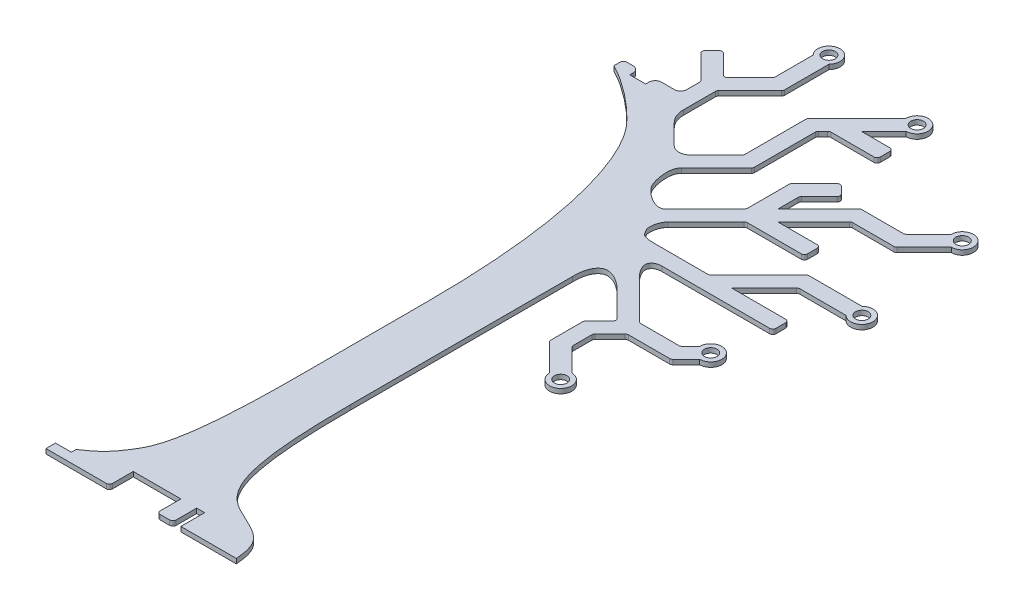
from build123d import *

# Parameters (mm, degrees)
SKETCH1_R           = 20
BOSS_EXTRUDE1_DEPTH = 15


with BuildPart() as part:
    # Sketch1 → Boss-Extrude1 (new body)
    with BuildSketch(Plane(origin=(0, 0, 0), x_dir=(1, 0, 0), z_dir=(0, 1, 0))):
        with BuildLine():
            Line((0, 45), (0, 30))
            Line((0, 30), (-50, 30))
            Line((-50, 30), (-50, 0))
            Line((-50, 0), (0, 0))
            Line((0, 0), (140, 0))
            ThreePointArc((140, 0), (147.071067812, 2.928932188), (150, 10))
            Line((150, 10), (150, 75))
            Line((150, 75), (300, 75))
            Line((300, 75), (300, 10))
            ThreePointArc((300, 10), (302.928932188, 2.928932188), (310, 0))
            Line((310, 0), (340, 0))
            ThreePointArc((340, 0), (347.071067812, 2.928932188), (350, 10))
            Line((350, 10), (350, 75))
            Line((350, 75), (375, 75))
            Line((375, 75), (375, 0))
            Line((375, 0), (550, 0))
            add(Edge.make_bspline(
                [(550, 0), (544.074466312, 70.036241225), (523.128514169, 94.047293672), (360.399300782, 163.901770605), (310, 258.354390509), (310, 600)],
                knots=[0, 0, 0, 0, 0.45768175, 0.55768175, 1, 1, 1, 1], degree=3))
            Line((310, 600), (310, 1300))
            add(Edge.make_bspline(
                [(310, 1300), (308.924670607, 1340.276245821), (324.105615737, 1364.652369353), (352.744485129, 1374.582953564), (380.181998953, 1365.981443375), (410, 1340)],
                knots=[0, 0, 0, 0, 0.489062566, 0.589062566, 1, 1, 1, 1], degree=3))
            Line((410, 1340), (494.852813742, 1255.147186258))
            ThreePointArc((494.852813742, 1255.147186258), (497.781745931, 1248.076118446), (494.852813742, 1241.005050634))
            Line((494.852813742, 1241.005050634), (452.426406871, 1198.578643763))
            ThreePointArc((452.426406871, 1198.578643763), (450.258679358, 1195.334410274), (449.497474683, 1191.507575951))
            Line((449.497474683, 1191.507575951), (449.497474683, 1091.507575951))
            ThreePointArc((449.497474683, 1091.507575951), (450.258679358, 1087.680741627), (452.426406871, 1084.436508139))
            Line((452.426406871, 1084.436508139), (537.279220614, 999.583694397))
            ThreePointArc((537.279220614, 999.583694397), (597.02613556, 975.192118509), (572.634559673, 1034.939033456))
            Line((572.634559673, 1034.939033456), (502.426406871, 1105.147186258))
            ThreePointArc((502.426406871, 1105.147186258), (500.258679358, 1108.391419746), (499.497474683, 1112.218254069))
            Line((499.497474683, 1112.218254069), (499.497474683, 1170.796897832))
            ThreePointArc((499.497474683, 1170.796897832), (500.258679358, 1174.623732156), (502.426406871, 1177.867965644))
            Line((502.426406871, 1177.867965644), (550.060966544, 1225.502525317))
            ThreePointArc((550.060966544, 1225.502525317), (553.305200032, 1227.67025283), (557.132034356, 1228.431457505))
            Line((557.132034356, 1228.431457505), (687.132034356, 1228.431457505))
            ThreePointArc((687.132034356, 1228.431457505), (690.95886868, 1229.19266218), (694.203102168, 1231.360389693))
            Line((694.203102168, 1231.360389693), (736.629509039, 1273.786796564))
            ThreePointArc((736.629509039, 1273.786796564), (761.021084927, 1333.533711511), (701.27416998, 1309.142135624))
            Line((701.27416998, 1309.142135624), (673.492424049, 1281.360389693))
            ThreePointArc((673.492424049, 1281.360389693), (670.248190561, 1279.19266218), (666.421356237, 1278.431457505))
            Line((666.421356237, 1278.431457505), (546.421356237, 1278.431457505))
            ThreePointArc((546.421356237, 1278.431457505), (542.594521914, 1279.19266218), (539.350288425, 1281.360389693))
            Line((539.350288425, 1281.360389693), (412.071067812, 1408.639610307))
            add(Edge.make_bspline(
                [(412.071067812, 1408.639610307), (401.489977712, 1419.329772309), (390.373832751, 1439.671334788), (394.121840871, 1461.239717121), (408.026312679, 1468.461283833), (422.071067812, 1468.639610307)],
                knots=[0, 0, 0, 0, 0.389885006, 0.489885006, 1, 1, 1, 1], degree=3))
            Line((422.071067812, 1468.639610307), (762.071067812, 1468.639610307))
            ThreePointArc((762.071067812, 1468.639610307), (769.142135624, 1471.568542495), (772.071067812, 1478.639610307))
            Line((772.071067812, 1478.639610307), (772.071067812, 1508.639610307))
            ThreePointArc((772.071067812, 1508.639610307), (769.142135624, 1515.710678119), (762.071067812, 1518.639610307))
            Line((762.071067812, 1518.639610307), (592.071067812, 1518.639610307))
            Line((592.071067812, 1518.639610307), (694.705627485, 1621.27416998))
            ThreePointArc((694.705627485, 1621.27416998), (697.949860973, 1623.441897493), (701.776695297, 1624.203102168))
            Line((701.776695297, 1624.203102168), (847.634559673, 1624.203102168))
            ThreePointArc((847.634559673, 1624.203102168), (907.129457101, 1649.203102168), (847.634559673, 1674.203102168))
            Line((847.634559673, 1674.203102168), (681.066017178, 1674.203102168))
            ThreePointArc((681.066017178, 1674.203102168), (677.239182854, 1673.441897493), (673.994949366, 1671.27416998))
            Line((673.994949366, 1671.27416998), (524.289321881, 1521.568542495))
            ThreePointArc((524.289321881, 1521.568542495), (521.045088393, 1519.400814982), (517.218254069, 1518.639610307))
            Line((517.218254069, 1518.639610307), (351.360389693, 1518.639610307))
            add(Edge.make_bspline(
                [(351.360389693, 1518.639610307), (307.601040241, 1518.477306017), (309.634364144, 1527.542383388), (291.450465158, 1551.931007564), (296.45347889, 1582.067054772), (311.360389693, 1598.639610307)],
                knots=[0, 0, 0, 0, 0.455016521, 0.455016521, 1, 1, 1, 1], degree=3))
            Line((311.360389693, 1598.639610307), (431.568542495, 1718.847763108))
            ThreePointArc((431.568542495, 1718.847763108), (434.812775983, 1721.015490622), (438.639610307, 1721.776695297))
            Line((438.639610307, 1721.776695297), (608.639610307, 1721.776695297))
            ThreePointArc((608.639610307, 1721.776695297), (615.710678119, 1724.705627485), (618.639610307, 1731.776695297))
            Line((618.639610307, 1731.776695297), (618.639610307, 1761.776695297))
            ThreePointArc((618.639610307, 1761.776695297), (615.710678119, 1768.847763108), (608.639610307, 1771.776695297))
            Line((608.639610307, 1771.776695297), (484.497474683, 1771.776695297))
            Line((484.497474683, 1771.776695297), (597.634559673, 1884.913780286))
            ThreePointArc((597.634559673, 1884.913780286), (600.878793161, 1887.0815078), (604.705627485, 1887.842712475))
            Line((604.705627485, 1887.842712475), (734.705627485, 1887.842712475))
            ThreePointArc((734.705627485, 1887.842712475), (738.532461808, 1888.60391715), (741.776695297, 1890.771644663))
            Line((741.776695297, 1890.771644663), (827.132034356, 1976.126983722))
            ThreePointArc((827.132034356, 1976.126983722), (851.523610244, 2035.873898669), (791.776695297, 2011.482322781))
            Line((791.776695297, 2011.482322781), (721.066017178, 1940.771644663))
            ThreePointArc((721.066017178, 1940.771644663), (717.82178369, 1938.60391715), (713.994949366, 1937.842712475))
            Line((713.994949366, 1937.842712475), (583.994949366, 1937.842712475))
            ThreePointArc((583.994949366, 1937.842712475), (580.168115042, 1937.0815078), (576.923881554, 1934.913780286))
            Line((576.923881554, 1934.913780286), (449.644660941, 1807.634559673))
            Line((449.644660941, 1807.634559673), (449.644660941, 1871.066017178))
            ThreePointArc((449.644660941, 1871.066017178), (450.405865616, 1874.892851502), (452.573593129, 1878.13708499))
            Line((452.573593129, 1878.13708499), (508.639610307, 1934.203102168))
            ThreePointArc((508.639610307, 1934.203102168), (511.568542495, 1941.27416998), (508.639610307, 1948.345237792))
            Line((508.639610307, 1948.345237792), (487.426406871, 1969.558441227))
            ThreePointArc((487.426406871, 1969.558441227), (480.355339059, 1972.487373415), (473.284271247, 1969.558441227))
            Line((473.284271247, 1969.558441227), (402.573593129, 1898.847763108))
            ThreePointArc((402.573593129, 1898.847763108), (400.405865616, 1895.60352962), (399.644660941, 1891.776695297))
            Line((399.644660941, 1891.776695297), (399.644660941, 1761.776695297))
            ThreePointArc((399.644660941, 1761.776695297), (398.883456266, 1757.949860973), (396.715728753, 1754.705627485))
            Line((396.715728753, 1754.705627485), (269.436508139, 1627.426406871))
            add(Edge.make_bspline(
                [(185.355339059, 1767.365440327), (165.883208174, 1747.893309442), (178.153717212, 1680.726386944), (216.029441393, 1636.572393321), (253.823103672, 1617.431392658), (269.436508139, 1627.426406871)],
                knots=[0, 0, 0, 0, 0.315307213, 0.415307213, 1, 1, 1, 1], degree=3))
            Line((185.355339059, 1767.365440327), (295.563491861, 1877.573593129))
            ThreePointArc((295.563491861, 1877.573593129), (297.731219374, 1880.817826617), (298.492424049, 1884.644660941))
            Line((298.492424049, 1884.644660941), (298.492424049, 2076.360389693))
            ThreePointArc((298.492424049, 2076.360389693), (299.253628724, 2080.187224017), (301.421356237, 2083.431457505))
            Line((301.421356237, 2083.431457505), (315.771644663, 2097.781745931))
            ThreePointArc((315.771644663, 2097.781745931), (319.015878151, 2099.949473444), (322.842712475, 2100.710678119))
            Line((322.842712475, 2100.710678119), (458.700576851, 2100.710678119))
            ThreePointArc((458.700576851, 2100.710678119), (465.771644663, 2103.639610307), (468.700576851, 2110.710678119))
            Line((468.700576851, 2110.710678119), (468.700576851, 2140.710678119))
            ThreePointArc((468.700576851, 2140.710678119), (465.771644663, 2147.781745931), (458.700576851, 2150.710678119))
            Line((458.700576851, 2150.710678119), (368.700576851, 2150.710678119))
            Line((368.700576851, 2150.710678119), (439.41125497, 2221.421356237))
            ThreePointArc((439.41125497, 2221.421356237), (463.802830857, 2281.168271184), (404.05591591, 2256.776695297))
            Line((404.05591591, 2256.776695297), (251.421356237, 2104.142135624))
            ThreePointArc((251.421356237, 2104.142135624), (249.253628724, 2100.897902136), (248.492424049, 2097.071067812))
            Line((248.492424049, 2097.071067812), (248.492424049, 1905.355339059))
            ThreePointArc((248.492424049, 1905.355339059), (247.731219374, 1901.528504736), (245.563491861, 1898.284271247))
            Line((245.563491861, 1898.284271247), (163.639610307, 1816.360389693))
            ThreePointArc((163.639610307, 1816.360389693), (138.639610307, 1806.005050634), (113.639610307, 1816.360389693))
            Line((113.639610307, 1816.360389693), (50, 1880))
            ThreePointArc((50, 1880), (34.868557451, 1902.94742298), (30, 1930))
            Line((30, 1930), (30, 2030))
            ThreePointArc((30, 2030), (30.761204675, 2033.826834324), (32.928932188, 2037.071067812))
            Line((32.928932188, 2037.071067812), (131.923881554, 2136.066017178))
            ThreePointArc((131.923881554, 2136.066017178), (134.091609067, 2139.310250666), (134.852813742, 2143.13708499))
            Line((134.852813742, 2143.13708499), (134.852813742, 2283.13708499))
            ThreePointArc((134.852813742, 2283.13708499), (109.852813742, 2342.631982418), (84.852813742, 2283.13708499))
            Line((84.852813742, 2283.13708499), (84.852813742, 2163.847763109))
            ThreePointArc((84.852813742, 2163.847763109), (84.091609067, 2160.020928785), (81.923881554, 2156.776695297))
            Line((81.923881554, 2156.776695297), (12.071067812, 2086.923881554))
            ThreePointArc((12.071067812, 2086.923881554), (5, 2083.994949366), (-2.071067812, 2086.923881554))
            Line((-2.071067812, 2086.923881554), (-61.819805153, 2146.672618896))
            ThreePointArc((-61.819805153, 2146.672618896), (-68.890872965, 2149.601551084), (-75.961940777, 2146.672618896))
            Line((-75.961940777, 2146.672618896), (-97.175144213, 2125.45941546))
            ThreePointArc((-97.175144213, 2125.45941546), (-100.104076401, 2118.388347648), (-97.175144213, 2111.317279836))
            Line((-97.175144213, 2111.317279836), (-22.928932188, 2037.071067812))
            ThreePointArc((-22.928932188, 2037.071067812), (-20.761204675, 2033.826834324), (-20, 2030))
            Line((-20, 2030), (-20, 1990))
            ThreePointArc((-20, 1990), (-25.857864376, 1975.857864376), (-40, 1970))
            Line((-40, 1970), (-80, 1970))
            ThreePointArc((-80, 1970), (-94.142135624, 1964.142135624), (-100, 1950))
            Line((-100, 1950), (-100, 1940))
            Line((-100, 1940), (-150, 1940))
            Line((-150, 1940), (-150, 1950))
            ThreePointArc((-150, 1950), (-155.857864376, 1964.142135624), (-170, 1970))
            Line((-170, 1970), (-190, 1970))
            ThreePointArc((-190, 1970), (-197.071067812, 1967.071067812), (-200, 1960))
            Line((-200, 1960), (-200, 1955))
            Line((-200, 1955), (-200, 1940))
            add(Edge.make_bspline(
                [(150, 1000), (150, 1445.602258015), (51.006573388, 1725.016691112), (-78.976821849, 1863.473741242), (-152.287509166, 1915.579243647), (-200, 1940)],
                knots=[0, 0, 0, 0, 0.484869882, 0.584869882, 1, 1, 1, 1], degree=3))
            Line((150, 1000), (150, 600))
            add(Edge.make_bspline(
                [(0, 45), (42.190133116, 73.159419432), (64.866199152, 93.70873088), (131.096536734, 207.970216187), (150, 358.468648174), (150, 600)],
                knots=[0, 0, 0, 0, 0.473245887, 0.573245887, 1, 1, 1, 1], degree=3))
        make_face()
        with Locations(Location((572.277398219, 999.940855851, 0), (0, 0, 90))):
            Circle(SKETCH1_R, mode=Mode.SUBTRACT)
        with Locations(Location((109.852813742, 2307.631982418, 0), (0, 0, 90))):
            Circle(SKETCH1_R, mode=Mode.SUBTRACT)
        with Locations(Location((736.272347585, 1308.78497417, 0), (0, 0, 90))):
            Circle(SKETCH1_R, mode=Mode.SUBTRACT)
        with Locations(Location((872.129457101, 1649.203102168, 0), (0, 0, 90))):
            Circle(SKETCH1_R, mode=Mode.SUBTRACT)
        with Locations(Location((439.054093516, 2256.419533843, 0), (0, 0, 90))):
            Circle(SKETCH1_R, mode=Mode.SUBTRACT)
        with Locations(Location((826.774872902, 2011.125161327, 0), (0, 0, 90))):
            Circle(SKETCH1_R, mode=Mode.SUBTRACT)
    extrude(amount=BOSS_EXTRUDE1_DEPTH)


solid = part.part
